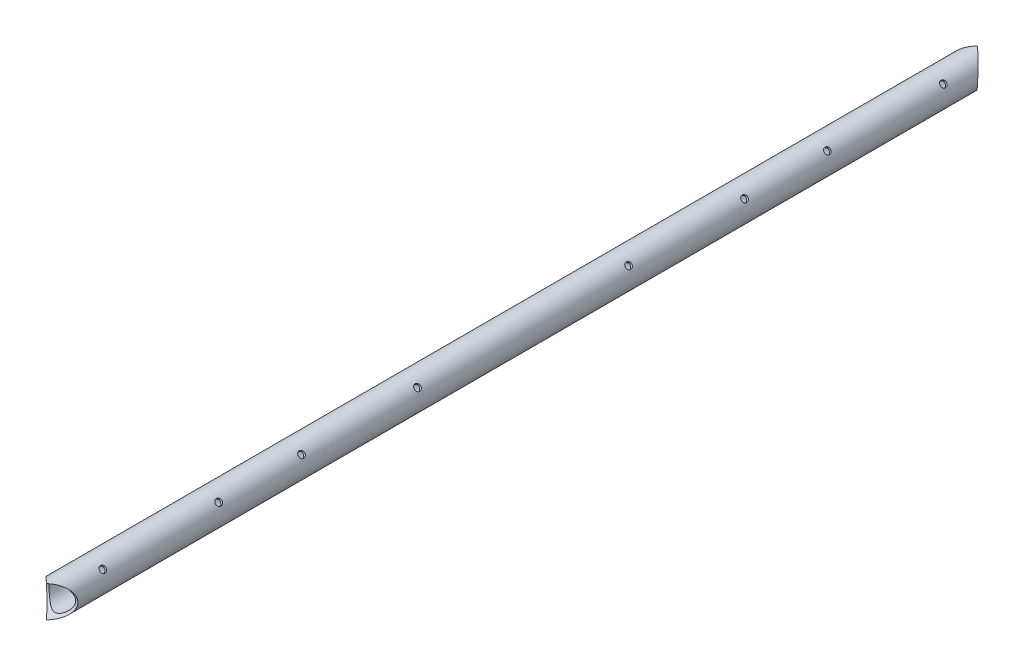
from build123d import *

# Parameters (mm, degrees)
SKETCH1_R          = 24.13
SKETCH1_R_2        = 20.447
EXTRUDE1_DEPTH     = 713.74
SKETCH3_R          = 4.826
CUT_EXTRUDE2_DEPTH = 25.4
SKETCH2_R          = 24.13


with BuildPart() as part:
    # Sketch1 → Extrude1 (new, symmetric)
    with BuildSketch(Plane.XY):
        Circle(SKETCH1_R)
        Circle(SKETCH1_R_2, mode=Mode.SUBTRACT)
    extrude(amount=EXTRUDE1_DEPTH, both=True)

    # Sketch3 → Cut-Extrude2 (cut, symmetric)
    with BuildSketch(Plane(origin=(0, 0, 0), x_dir=(0.7071067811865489, -0.7071067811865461, 0), z_dir=(0.7071067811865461, 0.7071067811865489, 0))):
        with Locations(Location((0, 644.398, 0), (0, 0, 180))):
            Circle(SKETCH3_R)
        with Locations(Location((0, 466.598, 0), (0, 0, 180))):
            Circle(SKETCH3_R)
        with Locations(Location((0, 339.598, 0), (0, 0, 180))):
            Circle(SKETCH3_R)
        with Locations(Location((0, 161.798, 0), (0, 0, 180))):
            Circle(SKETCH3_R)
    cut_extrude2 = extrude(amount=CUT_EXTRUDE2_DEPTH, both=True, mode=Mode.SUBTRACT)

    # Sketch2 → Cut-Revolve1 (revolve, cut)
    with BuildSketch(Plane(origin=(0, 0, 0), x_dir=(0, 0, -1), z_dir=(1, 0, 0))):
        with Locations((-713.74, 0)):
            Circle(SKETCH2_R)
        with Locations((713.74, 0)):
            Circle(SKETCH2_R)
    revolve(axis=Axis((0, -203.2, 116.48352763), (0, 0, -1)), mode=Mode.SUBTRACT)

    # Mirror2: Cut-Extrude2 across plane
    add(cut_extrude2.mirror(Plane.XY), mode=Mode.SUBTRACT)


solid = part.part
